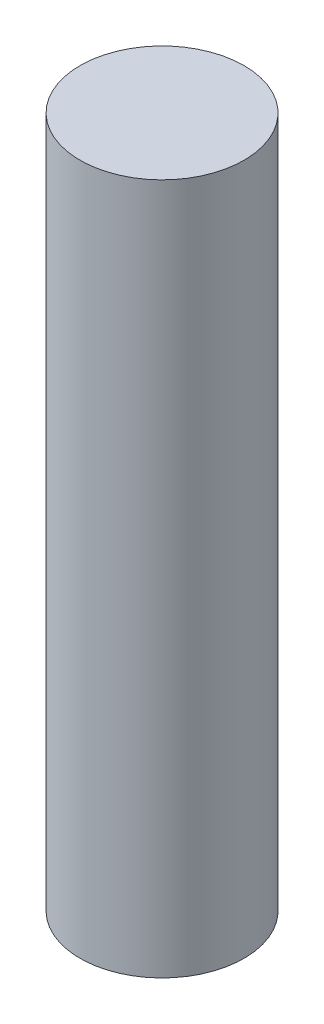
from build123d import *

# Parameters (mm, degrees)
CROQUIS3_W = 1.5
CROQUIS3_H = 12.64


with BuildPart() as part:
    # Croquis3 → Revoluci_n2 (revolve)
    with BuildSketch(Plane.XY, mode=Mode.PRIVATE) as revoluci_n2_sk:
        with Locations((0.75, 6.32)):
            Rectangle(CROQUIS3_W, CROQUIS3_H)
    revolve(revoluci_n2_sk.sketch.rotate(Axis((0, 0, 0), (0, 1, 0)), 90), axis=Axis((0, 0, 0), (0, 1, 0)))


solid = part.part
